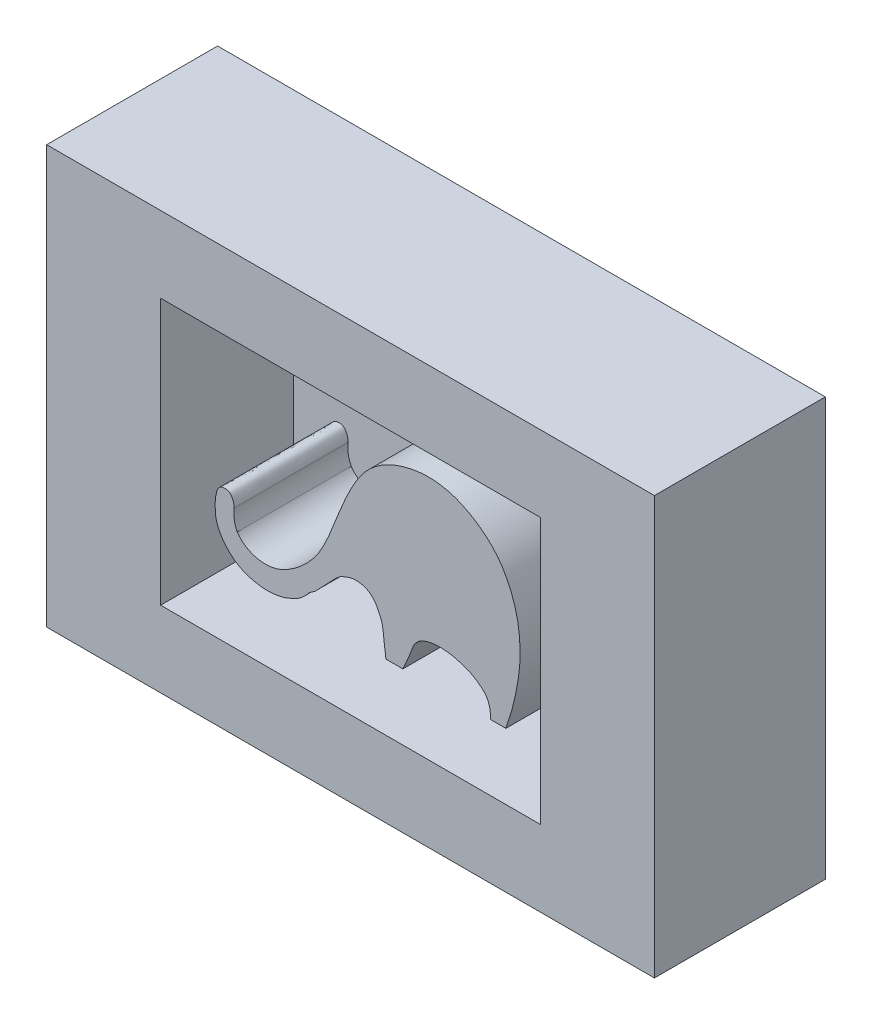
from build123d import *

# Parameters (mm, degrees)
CROQUIS1_W              = 160
CROQUIS1_H              = 110
SALIENTE_EXTRUIR1_DEPTH = 45
CROQUIS2_W              = 100
CROQUIS2_H              = 70
CORTAR_EXTRUIR1_DEPTH   = 35
SALIENTE_EXTRUIR2_DEPTH = 30


with BuildPart() as part:
    # Croquis1 → Saliente-Extruir1 (new body)
    with BuildSketch(Plane.XY):
        Rectangle(CROQUIS1_W, CROQUIS1_H)
    extrude(amount=SALIENTE_EXTRUIR1_DEPTH)

    # Croquis2 → Cortar-Extruir1 (cut)
    with BuildSketch(Plane.XY.offset(45)):
        Rectangle(CROQUIS2_W, CROQUIS2_H)
    extrude(amount=-CORTAR_EXTRUIR1_DEPTH, mode=Mode.SUBTRACT)

    # Croquis3 → Saliente-Extruir2 (add)
    with BuildSketch(Plane.XY.offset(10)):
        with BuildLine():
            Line((35.895745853, -22.635226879), (31.794752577, -22.635226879))
            add(Edge.make_bspline(
                [(31.794752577, -22.635226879), (31.909711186, -21.106472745), (31.554958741, -18.322843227), (28.879930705, -15.961806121), (26.490970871, -14.487947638), (23.610090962, -13.486107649), (20.400725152, -12.753372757), (17.227510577, -12.744630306), (14.921979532, -13.245566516), (13.142008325, -13.988086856), (11.410697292, -15.667600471), (10.879509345, -17.933122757), (10.088668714, -19.640803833), (9.514287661, -20.970855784), (9.069691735, -21.971098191), (8.780743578, -22.635226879)],
                knots=[0, 0, 0, 0, 0.140023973, 0.225017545, 0.307164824, 0.388944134, 0.494077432, 0.59824676, 0.667490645, 0.702034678, 0.76860024, 0.871495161, 0.902849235, 0.93574758, 1, 1, 1, 1], degree=3))
            Line((8.780743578, -22.635226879), (4.312749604, -22.635226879))
            add(Edge.make_bspline(
                [(4.312749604, -22.635226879), (4.155356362, -21.146487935), (3.719730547, -18.50337016), (3.513045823, -15.026864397), (2.450748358, -12.826486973), (1.731261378, -11.3774554), (0.905921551, -10.377557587), (-0.113808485, -9.454924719), (-1.534281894, -8.80356442), (-3.02044222, -8.573856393), (-4.28612684, -8.638587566), (-5.332944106, -8.800531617), (-6.288729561, -9.256893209), (-7.323874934, -9.568193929), (-8.228366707, -10.218280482), (-9.329808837, -11.246731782), (-10.519047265, -12.482651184), (-11.83310993, -13.867553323), (-12.816060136, -14.918870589), (-13.616921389, -15.730825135), (-14.588701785, -16.831958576), (-15.810963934, -17.294098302), (-16.793604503, -18.756568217), (-17.11343224, -18.927974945)],
                knots=[0, 0, 0, 0, 0.127317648, 0.2308815, 0.292326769, 0.334372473, 0.368783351, 0.402437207, 0.451160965, 0.499790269, 0.529441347, 0.559403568, 0.589436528, 0.619469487, 0.65114223, 0.683329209, 0.74843136, 0.797524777, 0.846618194, 0.87110558, 0.895592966, 0.968874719, 1, 1, 1, 1], degree=3))
            add(Edge.make_bspline(
                [(-17.11343224, -18.927974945), (-18.035312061, -19.919184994), (-19.458609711, -20.870007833), (-21.330351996, -21.548662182), (-22.443693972, -22.025339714), (-23.872465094, -22.346493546), (-25.557801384, -22.596246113), (-27.86634583, -22.673827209), (-30.277384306, -22.293248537), (-32.587948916, -21.672654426), (-34.20746727, -20.874789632), (-35.669827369, -19.967138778), (-37.028952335, -18.796065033), (-38.228237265, -17.441400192), (-39.22949847, -15.950449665), (-40.084044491, -14.275989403), (-40.582477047, -12.44533119), (-40.593177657, -10.939433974), (-40.705049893, -9.700732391), (-40.555690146, -8.819569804), (-40.546346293, -7.825241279), (-40.340133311, -7.285495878), (-40.252253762, -6.969233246)],
                knots=[0, 0, 0, 0, 0.089005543, 0.110191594, 0.131377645, 0.168788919, 0.206308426, 0.243784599, 0.32070959, 0.366379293, 0.401059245, 0.439406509, 0.479697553, 0.518947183, 0.558459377, 0.597893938, 0.64264345, 0.68198027, 0.697039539, 0.724441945, 0.740594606, 0.7621406, 0.7621406, 0.7621406, 0.7621406], degree=3))
            add(Edge.make_bspline(
                [(-40.252253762, -6.969233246), (-40.232827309, -6.271051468), (-39.550195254, -5.061138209), (-38.024986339, -4.848277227), (-36.905427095, -5.033711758), (-35.935417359, -6.208420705), (-35.654534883, -7.301534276), (-35.613840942, -8.125000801)],
                knots=[0, 0, 0, 0, 0.272951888, 0.450464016, 0.560638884, 0.693813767, 1, 1, 1, 1], degree=3))
            add(Edge.make_bspline(
                [(-35.613840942, -8.125000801), (-35.869803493, -9.935034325), (-35.606941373, -11.634277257), (-34.82525458, -13.222729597)],
                knots=[0.122664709, 0.122664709, 0.122664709, 0.122664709, 0.566029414, 0.566029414, 0.566029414, 0.566029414], degree=3))
            add(Edge.make_bspline(
                [(-34.82525458, -13.222729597), (-33.845340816, -14.71632271), (-30.626574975, -16.862319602), (-24.771807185, -17.072251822), (-18.737731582, -13.628142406), (-13.209824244, -7.974136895), (-9.436219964, 0.919825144), (-5.964943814, 10.193101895), (-0.395722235, 19.480697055), (8.959786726, 24.256251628), (19.04701659, 25.04256022), (28.040129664, 21.155600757), (33.935957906, 15.791842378), (37.444183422, 9.374509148), (39.090308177, 4.052368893), (39.678638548, -1.601868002), (39.689308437, -6.174934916), (38.956302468, -11.121102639), (37.92291764, -16.526573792), (36.63684955, -20.40797695), (35.895745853, -22.635226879)],
                knots=[0.065911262, 0.065911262, 0.065911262, 0.065911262, 0.103722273, 0.140927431, 0.184354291, 0.246171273, 0.305055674, 0.386128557, 0.457327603, 0.526828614, 0.599384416, 0.663992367, 0.728424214, 0.763825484, 0.8175769, 0.844805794, 0.883812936, 0.913819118, 0.950350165, 1, 1, 1, 1], degree=3))
        make_face()
    extrude(amount=SALIENTE_EXTRUIR2_DEPTH)


solid = part.part
